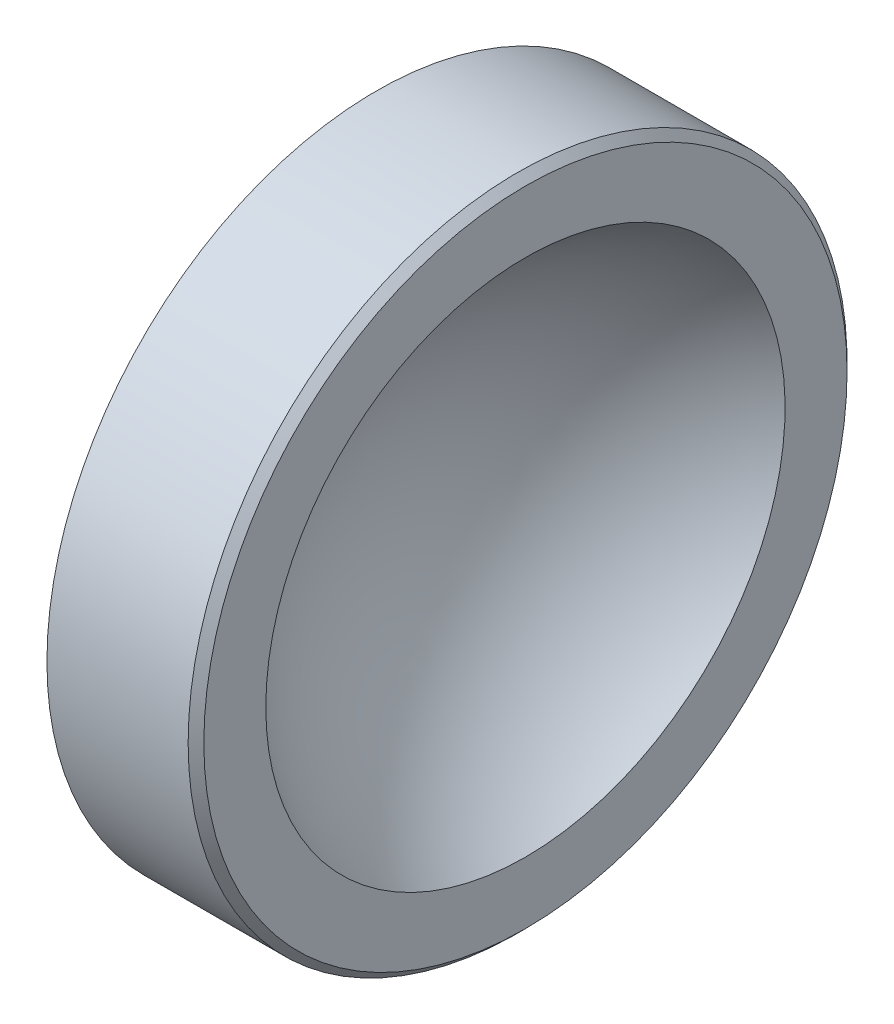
from build123d import *

# Parameters (mm, degrees)
CHAMFER1_SIZE = 0.25


with BuildPart() as part:
    # Sketch1 → Revolve1 (revolve)
    with BuildSketch(Plane.XY):
        with BuildLine():
            Line((0.149991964, 0), (-0.5, 0))
            ThreePointArc((-0.5, 0), (-0.374929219, -5.25594901), (0, -10.5))
            Line((0, -10.5), (4.75, -10.5))
            Line((4.75, -10.5), (4.75, -8.275))
            ThreePointArc((4.75, -8.275), (1.377294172, -4.73380658), (0.149991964, 0))
        make_face()
    revolve(axis=Axis((-2.589277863, 0, 0), (1, 0, 0)))

    # Chamfer1
    chamfer1_edges = [part.edges().sort_by_distance(p)[0] for p in [
        (4.75, 10.5, 0),
    ]]
    chamfer(chamfer1_edges, length=CHAMFER1_SIZE)


solid = part.part
